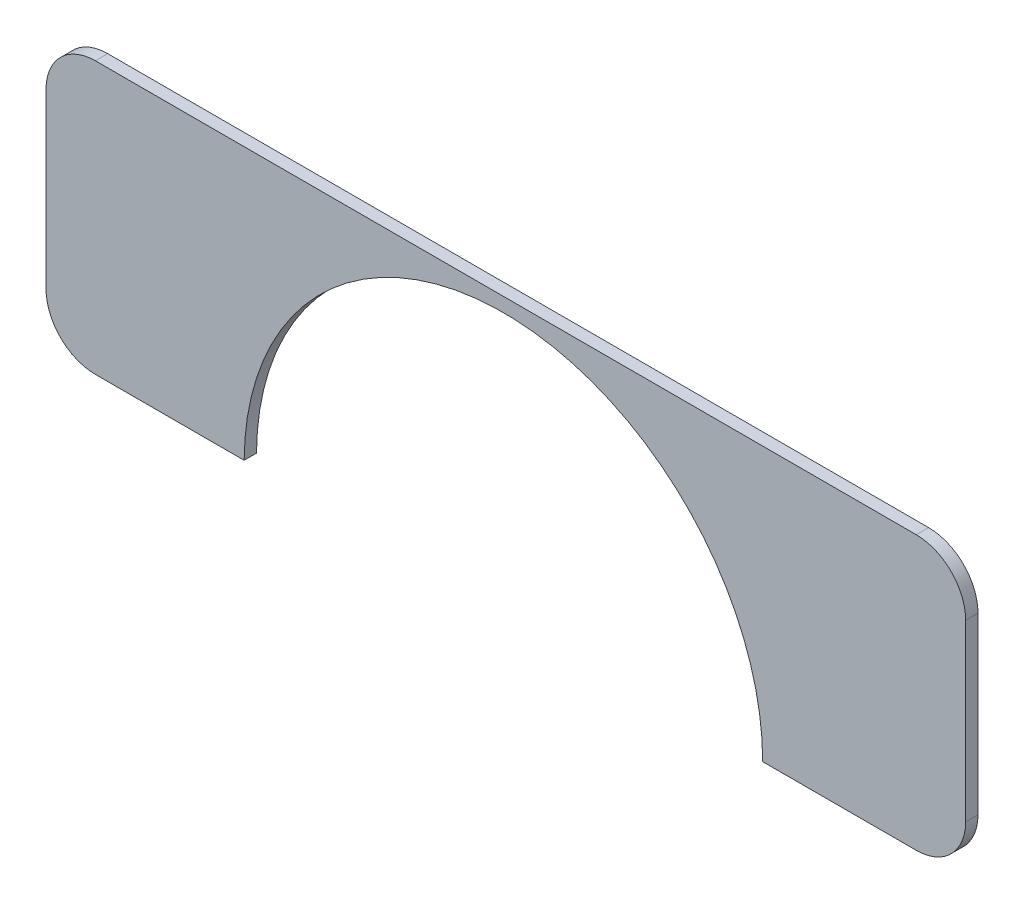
from build123d import *

# Parameters (mm, degrees)
BOSS_EXTRUDE1_DEPTH = 3.175
FILLET1_R           = 12.7


with BuildPart() as part:
    # Sketch1 → Boss-Extrude1 (new body)
    with BuildSketch(Plane.XY):
        with BuildLine():
            Line((0, 109.22), (-52.197, 109.22))
            ThreePointArc((-52.197, 109.22), (-118.650018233, 175.894630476), (-185.545521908, 109.663961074))
            Line((-185.545521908, 109.663961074), (-236.5, 109.663961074))
            Line((-236.5, 109.663961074), (-236.5, 179.513961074))
            Line((-236.5, 179.513961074), (0, 179.513961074))
            Line((0, 179.513961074), (0, 109.22))
        make_face()
    extrude(amount=BOSS_EXTRUDE1_DEPTH)

    # Fillet1
    fillet1_edges = [part.edges().sort_by_distance(p)[0] for p in [
        (0, 109.22, 1.5875),
        (-236.5, 109.663961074, 1.5875),
        (-236.5, 179.513961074, 1.5875),
        (0, 179.513961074, 1.5875),
    ]]
    fillet(fillet1_edges, radius=FILLET1_R)


solid = part.part
